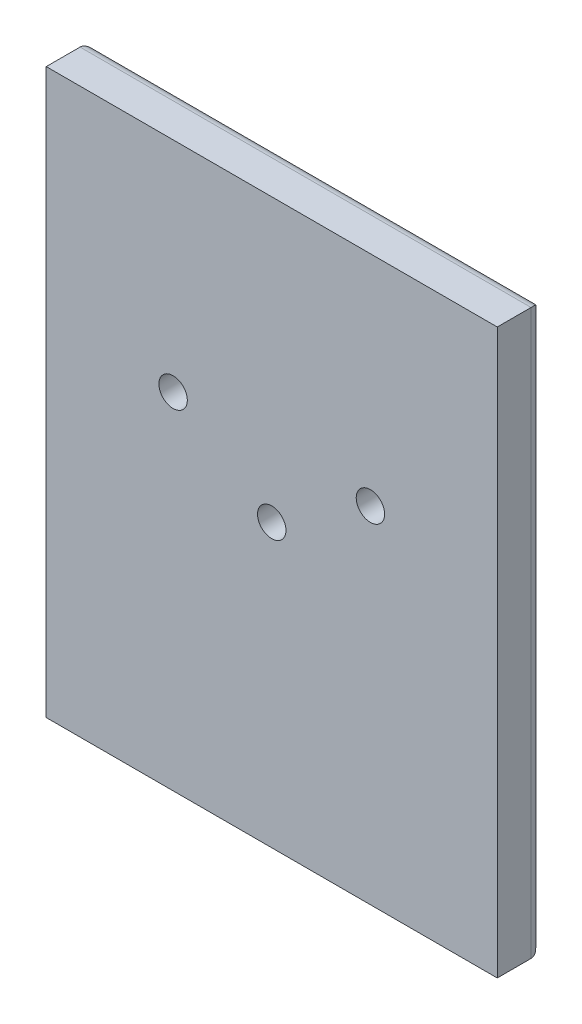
ISO-10303-21;
HEADER;
FILE_DESCRIPTION(('STEP AP214'),'2;1');
FILE_NAME('part.step','',(''),(''),'','','');
FILE_SCHEMA(('AUTOMOTIVE_DESIGN { 1 0 10303 214 1 1 1 1 }'));
ENDSEC;
DATA;
#1=APPLICATION_CONTEXT('core data for automotive mechanical design processes');
#2=APPLICATION_PROTOCOL_DEFINITION('international standard','automotive_design',2000,#1);
#3=PRODUCT_CONTEXT('',#1,'mechanical');
#4=PRODUCT('Part','Part','',(#3));
#5=PRODUCT_RELATED_PRODUCT_CATEGORY('part','',(#4));
#6=PRODUCT_DEFINITION_FORMATION('','',#4);
#7=PRODUCT_DEFINITION_CONTEXT('part definition',#1,'design');
#8=PRODUCT_DEFINITION('design','',#6,#7);
#9=PRODUCT_DEFINITION_SHAPE('','',#8);
#10=(LENGTH_UNIT() NAMED_UNIT(*) SI_UNIT(.MILLI.,.METRE.));
#11=(NAMED_UNIT(*) PLANE_ANGLE_UNIT() SI_UNIT($,.RADIAN.));
#12=(NAMED_UNIT(*) SI_UNIT($,.STERADIAN.) SOLID_ANGLE_UNIT());
#13=UNCERTAINTY_MEASURE_WITH_UNIT(LENGTH_MEASURE(1.E-05),#10,'distance_accuracy_value','');
#14=(GEOMETRIC_REPRESENTATION_CONTEXT(3) GLOBAL_UNCERTAINTY_ASSIGNED_CONTEXT((#13)) GLOBAL_UNIT_ASSIGNED_CONTEXT((#10,
#11,#12)) REPRESENTATION_CONTEXT('',''));
#15=CARTESIAN_POINT('',(0.,0.,0.));
#16=DIRECTION('',(0.,0.,1.));
#17=DIRECTION('',(1.,0.,0.));
#18=AXIS2_PLACEMENT_3D('',#15,#16,#17);
#19=CARTESIAN_POINT('',(58.42,6.35,10.16));
#20=DIRECTION('',(-1.,0.,0.));
#21=DIRECTION('',(0.,-1.,0.));
#22=AXIS2_PLACEMENT_3D('',#19,#20,#21);
#23=PLANE('',#22);
#24=DIRECTION('',(0.,0.,-1.));
#25=VECTOR('',#24,1.);
#26=CARTESIAN_POINT('',(58.42,-120.65,10.16));
#27=LINE('',#26,#25);
#28=CARTESIAN_POINT('',(58.42,-120.65,10.16));
#29=VERTEX_POINT('',#28);
#30=CARTESIAN_POINT('',(58.42,-120.65,2.54));
#31=VERTEX_POINT('',#30);
#32=EDGE_CURVE('E210',#29,#31,#27,.T.);
#33=ORIENTED_EDGE('',*,*,#32,.T.);
#34=DIRECTION('',(0.,1.,0.));
#35=VECTOR('',#34,1.);
#36=CARTESIAN_POINT('',(58.42,6.35,2.54));
#37=LINE('',#36,#35);
#38=CARTESIAN_POINT('',(58.42,6.35,2.54));
#39=VERTEX_POINT('',#38);
#40=EDGE_CURVE('E103',#31,#39,#37,.T.);
#41=ORIENTED_EDGE('',*,*,#40,.T.);
#42=DIRECTION('',(0.,0.,-1.));
#43=VECTOR('',#42,1.);
#44=CARTESIAN_POINT('',(58.42,6.35,10.16));
#45=LINE('',#44,#43);
#46=CARTESIAN_POINT('',(58.42,6.35,10.16));
#47=VERTEX_POINT('',#46);
#48=EDGE_CURVE('E86',#47,#39,#45,.T.);
#49=ORIENTED_EDGE('',*,*,#48,.F.);
#50=DIRECTION('',(0.,1.,0.));
#51=VECTOR('',#50,1.);
#52=CARTESIAN_POINT('',(58.42,6.35,10.16));
#53=LINE('',#52,#51);
#54=EDGE_CURVE('E91',#29,#47,#53,.T.);
#55=ORIENTED_EDGE('',*,*,#54,.F.);
#56=EDGE_LOOP('',(#33,#41,#49,#55));
#57=FACE_BOUND('',#56,.T.);
#58=ADVANCED_FACE('F30',(#57),#23,.F.);
#59=CARTESIAN_POINT('',(58.42,6.35,10.16));
#60=DIRECTION('',(0.,-1.,0.));
#61=DIRECTION('',(0.,0.,-1.));
#62=AXIS2_PLACEMENT_3D('',#59,#60,#61);
#63=PLANE('',#62);
#64=ORIENTED_EDGE('',*,*,#48,.T.);
#65=DIRECTION('',(-1.,0.,0.));
#66=VECTOR('',#65,1.);
#67=CARTESIAN_POINT('',(-43.18,6.35,2.54));
#68=LINE('',#67,#66);
#69=CARTESIAN_POINT('',(-43.18,6.35,2.54));
#70=VERTEX_POINT('',#69);
#71=EDGE_CURVE('E11',#39,#70,#68,.T.);
#72=ORIENTED_EDGE('',*,*,#71,.T.);
#73=DIRECTION('',(0.,0.,-1.));
#74=VECTOR('',#73,1.);
#75=CARTESIAN_POINT('',(-43.18,6.35,10.16));
#76=LINE('',#75,#74);
#77=CARTESIAN_POINT('',(-43.18,6.35,10.16));
#78=VERTEX_POINT('',#77);
#79=EDGE_CURVE('E87',#78,#70,#76,.T.);
#80=ORIENTED_EDGE('',*,*,#79,.F.);
#81=DIRECTION('',(-1.,0.,0.));
#82=VECTOR('',#81,1.);
#83=CARTESIAN_POINT('',(58.42,6.35,10.16));
#84=LINE('',#83,#82);
#85=EDGE_CURVE('E82',#47,#78,#84,.T.);
#86=ORIENTED_EDGE('',*,*,#85,.F.);
#87=EDGE_LOOP('',(#64,#72,#80,#86));
#88=FACE_BOUND('',#87,.T.);
#89=ADVANCED_FACE('F84',(#88),#63,.F.);
#90=CARTESIAN_POINT('',(-43.18,6.35,10.16));
#91=DIRECTION('',(1.,0.,0.));
#92=DIRECTION('',(0.,1.,0.));
#93=AXIS2_PLACEMENT_3D('',#90,#91,#92);
#94=PLANE('',#93);
#95=ORIENTED_EDGE('',*,*,#79,.T.);
#96=DIRECTION('',(0.,-1.,0.));
#97=VECTOR('',#96,1.);
#98=CARTESIAN_POINT('',(-43.18,-120.65,2.54));
#99=LINE('',#98,#97);
#100=CARTESIAN_POINT('',(-43.18,-120.65,2.54));
#101=VERTEX_POINT('',#100);
#102=EDGE_CURVE('E39',#70,#101,#99,.T.);
#103=ORIENTED_EDGE('',*,*,#102,.T.);
#104=DIRECTION('',(0.,0.,-1.));
#105=VECTOR('',#104,1.);
#106=CARTESIAN_POINT('',(-43.18,-120.65,10.16));
#107=LINE('',#106,#105);
#108=CARTESIAN_POINT('',(-43.18,-120.65,10.16));
#109=VERTEX_POINT('',#108);
#110=EDGE_CURVE('E107',#109,#101,#107,.T.);
#111=ORIENTED_EDGE('',*,*,#110,.F.);
#112=DIRECTION('',(0.,-1.,0.));
#113=VECTOR('',#112,1.);
#114=CARTESIAN_POINT('',(-43.18,6.35,10.16));
#115=LINE('',#114,#113);
#116=EDGE_CURVE('E90',#78,#109,#115,.T.);
#117=ORIENTED_EDGE('',*,*,#116,.F.);
#118=EDGE_LOOP('',(#95,#103,#111,#117));
#119=FACE_BOUND('',#118,.T.);
#120=ADVANCED_FACE('F160',(#119),#94,.F.);
#121=CARTESIAN_POINT('',(58.42,-120.65,10.16));
#122=DIRECTION('',(0.,1.,0.));
#123=DIRECTION('',(0.,0.,1.));
#124=AXIS2_PLACEMENT_3D('',#121,#122,#123);
#125=PLANE('',#124);
#126=ORIENTED_EDGE('',*,*,#110,.T.);
#127=DIRECTION('',(1.,0.,0.));
#128=VECTOR('',#127,1.);
#129=CARTESIAN_POINT('',(58.42,-120.65,2.54));
#130=LINE('',#129,#128);
#131=EDGE_CURVE('E119',#101,#31,#130,.T.);
#132=ORIENTED_EDGE('',*,*,#131,.T.);
#133=ORIENTED_EDGE('',*,*,#32,.F.);
#134=DIRECTION('',(1.,0.,0.));
#135=VECTOR('',#134,1.);
#136=CARTESIAN_POINT('',(58.42,-120.65,10.16));
#137=LINE('',#136,#135);
#138=EDGE_CURVE('E96',#109,#29,#137,.T.);
#139=ORIENTED_EDGE('',*,*,#138,.F.);
#140=EDGE_LOOP('',(#126,#132,#133,#139));
#141=FACE_BOUND('',#140,.T.);
#142=ADVANCED_FACE('F165',(#141),#125,.F.);
#143=CARTESIAN_POINT('',(58.42,-120.65,10.16));
#144=DIRECTION('',(0.,0.,-1.));
#145=DIRECTION('',(-1.,0.,0.));
#146=AXIS2_PLACEMENT_3D('',#143,#144,#145);
#147=PLANE('',#146);
#148=CARTESIAN_POINT('',(7.62000000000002,-57.15,10.16));
#149=DIRECTION('',(0.,0.,-1.));
#150=DIRECTION('',(-1.,0.,0.));
#151=AXIS2_PLACEMENT_3D('',#148,#149,#150);
#152=CIRCLE('',#151,3.2004);
#153=CARTESIAN_POINT('',(4.41960000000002,-57.15,10.16));
#154=VERTEX_POINT('',#153);
#155=EDGE_CURVE('E190',#154,#154,#152,.T.);
#156=ORIENTED_EDGE('',*,*,#155,.T.);
#157=EDGE_LOOP('',(#156));
#158=FACE_BOUND('',#157,.T.);
#159=CARTESIAN_POINT('',(-14.605,-42.8625,10.16));
#160=DIRECTION('',(0.,0.,-1.));
#161=DIRECTION('',(-1.,0.,0.));
#162=AXIS2_PLACEMENT_3D('',#159,#160,#161);
#163=CIRCLE('',#162,3.2004);
#164=CARTESIAN_POINT('',(-17.8054,-42.8625,10.16));
#165=VERTEX_POINT('',#164);
#166=EDGE_CURVE('E198',#165,#165,#163,.T.);
#167=ORIENTED_EDGE('',*,*,#166,.T.);
#168=EDGE_LOOP('',(#167));
#169=FACE_BOUND('',#168,.T.);
#170=CARTESIAN_POINT('',(29.845,-42.8625,10.16));
#171=DIRECTION('',(0.,0.,-1.));
#172=DIRECTION('',(-1.,0.,0.));
#173=AXIS2_PLACEMENT_3D('',#170,#171,#172);
#174=CIRCLE('',#173,3.2004);
#175=CARTESIAN_POINT('',(26.6446,-42.8625,10.16));
#176=VERTEX_POINT('',#175);
#177=EDGE_CURVE('E125',#176,#176,#174,.T.);
#178=ORIENTED_EDGE('',*,*,#177,.T.);
#179=EDGE_LOOP('',(#178));
#180=FACE_BOUND('',#179,.T.);
#181=ORIENTED_EDGE('',*,*,#54,.T.);
#182=ORIENTED_EDGE('',*,*,#85,.T.);
#183=ORIENTED_EDGE('',*,*,#116,.T.);
#184=ORIENTED_EDGE('',*,*,#138,.T.);
#185=EDGE_LOOP('',(#181,#182,#183,#184));
#186=FACE_BOUND('',#185,.T.);
#187=ADVANCED_FACE('F94',(#158,#169,#180,#186),#147,.F.);
#188=CARTESIAN_POINT('',(58.42,-120.65,0.));
#189=DIRECTION('',(0.,0.,-1.));
#190=DIRECTION('',(-1.,0.,0.));
#191=AXIS2_PLACEMENT_3D('',#188,#189,#190);
#192=PLANE('',#191);
#193=CARTESIAN_POINT('',(7.62000000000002,-57.15,0.));
#194=DIRECTION('',(0.,0.,-1.));
#195=DIRECTION('',(-1.,0.,0.));
#196=AXIS2_PLACEMENT_3D('',#193,#194,#195);
#197=CIRCLE('',#196,3.2004);
#198=CARTESIAN_POINT('',(4.41960000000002,-57.15,0.));
#199=VERTEX_POINT('',#198);
#200=EDGE_CURVE('E193',#199,#199,#197,.T.);
#201=ORIENTED_EDGE('',*,*,#200,.F.);
#202=EDGE_LOOP('',(#201));
#203=FACE_BOUND('',#202,.T.);
#204=CARTESIAN_POINT('',(-14.605,-42.8625,0.));
#205=DIRECTION('',(0.,0.,-1.));
#206=DIRECTION('',(-1.,0.,0.));
#207=AXIS2_PLACEMENT_3D('',#204,#205,#206);
#208=CIRCLE('',#207,3.2004);
#209=CARTESIAN_POINT('',(-17.8054,-42.8625,0.));
#210=VERTEX_POINT('',#209);
#211=EDGE_CURVE('E195',#210,#210,#208,.T.);
#212=ORIENTED_EDGE('',*,*,#211,.F.);
#213=EDGE_LOOP('',(#212));
#214=FACE_BOUND('',#213,.T.);
#215=CARTESIAN_POINT('',(29.845,-42.8625,0.));
#216=DIRECTION('',(0.,0.,-1.));
#217=DIRECTION('',(-1.,0.,0.));
#218=AXIS2_PLACEMENT_3D('',#215,#216,#217);
#219=CIRCLE('',#218,3.2004);
#220=CARTESIAN_POINT('',(26.6446,-42.8625,0.));
#221=VERTEX_POINT('',#220);
#222=EDGE_CURVE('E201',#221,#221,#219,.T.);
#223=ORIENTED_EDGE('',*,*,#222,.F.);
#224=EDGE_LOOP('',(#223));
#225=FACE_BOUND('',#224,.T.);
#226=DIRECTION('',(-1.,0.,0.));
#227=VECTOR('',#226,1.);
#228=CARTESIAN_POINT('',(58.42,3.81,0.));
#229=LINE('',#228,#227);
#230=CARTESIAN_POINT('',(-40.64,3.81,0.));
#231=VERTEX_POINT('',#230);
#232=CARTESIAN_POINT('',(55.88,3.81,0.));
#233=VERTEX_POINT('',#232);
#234=EDGE_CURVE('E105',#231,#233,#229,.F.);
#235=ORIENTED_EDGE('',*,*,#234,.T.);
#236=DIRECTION('',(0.,1.,0.));
#237=VECTOR('',#236,1.);
#238=CARTESIAN_POINT('',(55.88,-120.65,0.));
#239=LINE('',#238,#237);
#240=CARTESIAN_POINT('',(55.88,-118.11,0.));
#241=VERTEX_POINT('',#240);
#242=EDGE_CURVE('E116',#233,#241,#239,.F.);
#243=ORIENTED_EDGE('',*,*,#242,.T.);
#244=DIRECTION('',(1.,0.,0.));
#245=VECTOR('',#244,1.);
#246=CARTESIAN_POINT('',(-43.18,-118.11,0.));
#247=LINE('',#246,#245);
#248=CARTESIAN_POINT('',(-40.64,-118.11,0.));
#249=VERTEX_POINT('',#248);
#250=EDGE_CURVE('E114',#241,#249,#247,.F.);
#251=ORIENTED_EDGE('',*,*,#250,.T.);
#252=DIRECTION('',(0.,-1.,0.));
#253=VECTOR('',#252,1.);
#254=CARTESIAN_POINT('',(-40.64,6.35,0.));
#255=LINE('',#254,#253);
#256=EDGE_CURVE('E112',#249,#231,#255,.F.);
#257=ORIENTED_EDGE('',*,*,#256,.T.);
#258=EDGE_LOOP('',(#235,#243,#251,#257));
#259=FACE_BOUND('',#258,.T.);
#260=ADVANCED_FACE('F141',(#203,#214,#225,#259),#192,.T.);
#261=CARTESIAN_POINT('',(-40.64,6.35,2.54));
#262=DIRECTION('',(0.,1.,0.));
#263=DIRECTION('',(-1.,0.,0.));
#264=AXIS2_PLACEMENT_3D('',#261,#262,#263);
#265=CYLINDRICAL_SURFACE('',#264,2.54);
#266=CARTESIAN_POINT('',(-40.64,3.81,2.54));
#267=DIRECTION('',(0.707106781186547,0.707106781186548,0.));
#268=DIRECTION('',(0.707106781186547,-0.707106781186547,0.));
#269=AXIS2_PLACEMENT_3D('',#266,#267,#268);
#270=ELLIPSE('',#269,3.59210244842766,2.54);
#271=EDGE_CURVE('E126',#231,#70,#270,.T.);
#272=ORIENTED_EDGE('',*,*,#271,.F.);
#273=ORIENTED_EDGE('',*,*,#256,.F.);
#274=CARTESIAN_POINT('',(-40.64,-118.11,2.54));
#275=DIRECTION('',(-0.707106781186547,0.707106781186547,0.));
#276=DIRECTION('',(0.707106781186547,0.707106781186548,0.));
#277=AXIS2_PLACEMENT_3D('',#274,#275,#276);
#278=ELLIPSE('',#277,3.59210244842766,2.54);
#279=EDGE_CURVE('E34',#101,#249,#278,.F.);
#280=ORIENTED_EDGE('',*,*,#279,.F.);
#281=ORIENTED_EDGE('',*,*,#102,.F.);
#282=EDGE_LOOP('',(#272,#273,#280,#281));
#283=FACE_BOUND('',#282,.T.);
#284=ADVANCED_FACE('F32',(#283),#265,.T.);
#285=CARTESIAN_POINT('',(58.42,-118.11,2.54));
#286=DIRECTION('',(-1.,0.,0.));
#287=DIRECTION('',(0.,0.,1.));
#288=AXIS2_PLACEMENT_3D('',#285,#286,#287);
#289=CYLINDRICAL_SURFACE('',#288,2.54);
#290=ORIENTED_EDGE('',*,*,#279,.T.);
#291=ORIENTED_EDGE('',*,*,#250,.F.);
#292=CARTESIAN_POINT('',(55.88,-118.11,2.54));
#293=DIRECTION('',(-0.707106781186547,-0.707106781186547,0.));
#294=DIRECTION('',(-0.707106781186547,0.707106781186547,0.));
#295=AXIS2_PLACEMENT_3D('',#292,#293,#294);
#296=ELLIPSE('',#295,3.59210244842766,2.54);
#297=EDGE_CURVE('E124',#31,#241,#296,.F.);
#298=ORIENTED_EDGE('',*,*,#297,.F.);
#299=ORIENTED_EDGE('',*,*,#131,.F.);
#300=EDGE_LOOP('',(#290,#291,#298,#299));
#301=FACE_BOUND('',#300,.T.);
#302=ADVANCED_FACE('F136',(#301),#289,.T.);
#303=CARTESIAN_POINT('',(58.42,3.81,2.54));
#304=DIRECTION('',(1.,0.,0.));
#305=DIRECTION('',(0.,0.,-1.));
#306=AXIS2_PLACEMENT_3D('',#303,#304,#305);
#307=CYLINDRICAL_SURFACE('',#306,2.54);
#308=ORIENTED_EDGE('',*,*,#271,.T.);
#309=ORIENTED_EDGE('',*,*,#71,.F.);
#310=CARTESIAN_POINT('',(55.88,3.81,2.54));
#311=DIRECTION('',(0.707106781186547,-0.707106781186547,0.));
#312=DIRECTION('',(0.707106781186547,0.707106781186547,0.));
#313=AXIS2_PLACEMENT_3D('',#310,#311,#312);
#314=ELLIPSE('',#313,3.59210244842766,2.54);
#315=EDGE_CURVE('E122',#233,#39,#314,.T.);
#316=ORIENTED_EDGE('',*,*,#315,.F.);
#317=ORIENTED_EDGE('',*,*,#234,.F.);
#318=EDGE_LOOP('',(#308,#309,#316,#317));
#319=FACE_BOUND('',#318,.T.);
#320=ADVANCED_FACE('F146',(#319),#307,.T.);
#321=CARTESIAN_POINT('',(55.88,6.35,2.54));
#322=DIRECTION('',(0.,-1.,0.));
#323=DIRECTION('',(1.,0.,0.));
#324=AXIS2_PLACEMENT_3D('',#321,#322,#323);
#325=CYLINDRICAL_SURFACE('',#324,2.54);
#326=ORIENTED_EDGE('',*,*,#297,.T.);
#327=ORIENTED_EDGE('',*,*,#242,.F.);
#328=ORIENTED_EDGE('',*,*,#315,.T.);
#329=ORIENTED_EDGE('',*,*,#40,.F.);
#330=EDGE_LOOP('',(#326,#327,#328,#329));
#331=FACE_BOUND('',#330,.T.);
#332=ADVANCED_FACE('F145',(#331),#325,.T.);
#333=CARTESIAN_POINT('',(29.845,-42.8625,10.16));
#334=DIRECTION('',(0.,0.,-1.));
#335=DIRECTION('',(-1.,0.,0.));
#336=AXIS2_PLACEMENT_3D('',#333,#334,#335);
#337=CYLINDRICAL_SURFACE('',#336,3.2004);
#338=ORIENTED_EDGE('',*,*,#177,.F.);
#339=EDGE_LOOP('',(#338));
#340=FACE_BOUND('',#339,.T.);
#341=ORIENTED_EDGE('',*,*,#222,.T.);
#342=EDGE_LOOP('',(#341));
#343=FACE_BOUND('',#342,.T.);
#344=ADVANCED_FACE('F153',(#340,#343),#337,.F.);
#345=CARTESIAN_POINT('',(-14.605,-42.8625,10.16));
#346=DIRECTION('',(0.,0.,-1.));
#347=DIRECTION('',(-1.,0.,0.));
#348=AXIS2_PLACEMENT_3D('',#345,#346,#347);
#349=CYLINDRICAL_SURFACE('',#348,3.2004);
#350=ORIENTED_EDGE('',*,*,#166,.F.);
#351=EDGE_LOOP('',(#350));
#352=FACE_BOUND('',#351,.T.);
#353=ORIENTED_EDGE('',*,*,#211,.T.);
#354=EDGE_LOOP('',(#353));
#355=FACE_BOUND('',#354,.T.);
#356=ADVANCED_FACE('F177',(#352,#355),#349,.F.);
#357=CARTESIAN_POINT('',(7.62000000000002,-57.15,10.16));
#358=DIRECTION('',(0.,0.,-1.));
#359=DIRECTION('',(-1.,0.,0.));
#360=AXIS2_PLACEMENT_3D('',#357,#358,#359);
#361=CYLINDRICAL_SURFACE('',#360,3.2004);
#362=ORIENTED_EDGE('',*,*,#155,.F.);
#363=EDGE_LOOP('',(#362));
#364=FACE_BOUND('',#363,.T.);
#365=ORIENTED_EDGE('',*,*,#200,.T.);
#366=EDGE_LOOP('',(#365));
#367=FACE_BOUND('',#366,.T.);
#368=ADVANCED_FACE('F181',(#364,#367),#361,.F.);
#369=CLOSED_SHELL('',(#58,#89,#120,#142,#187,#260,#284,#302,#320,#332,#344,#356,#368));
#370=MANIFOLD_SOLID_BREP('B2',#369);
#371=ADVANCED_BREP_SHAPE_REPRESENTATION('',(#18,#370),#14);
#372=SHAPE_DEFINITION_REPRESENTATION(#9,#371);
ENDSEC;
END-ISO-10303-21;
